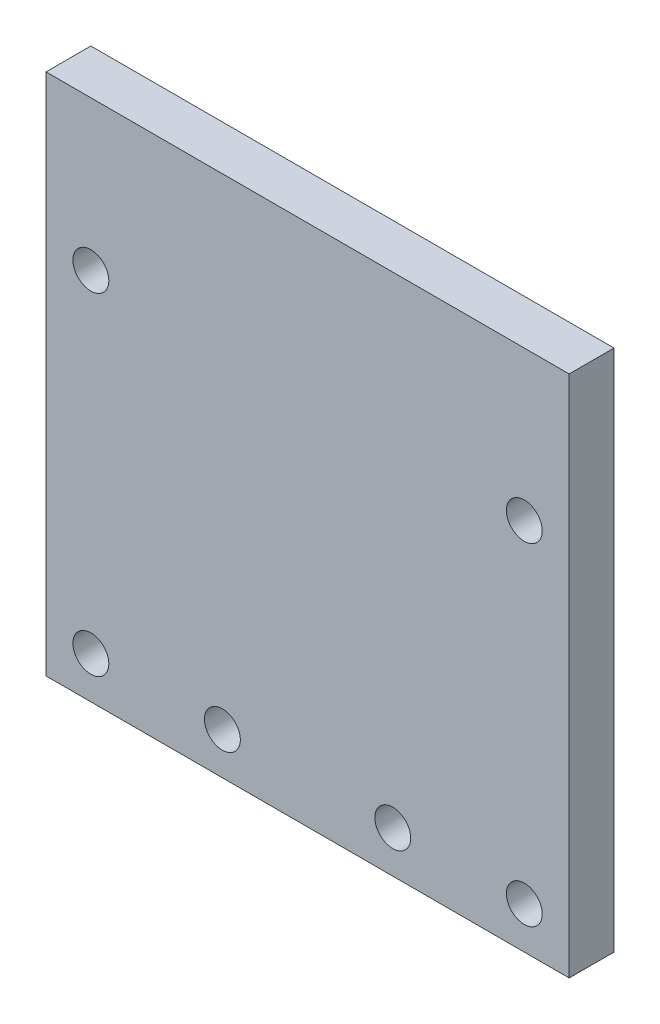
ISO-10303-21;
HEADER;
FILE_DESCRIPTION(('STEP AP214'),'2;1');
FILE_NAME('part.step','',(''),(''),'','','');
FILE_SCHEMA(('AUTOMOTIVE_DESIGN { 1 0 10303 214 1 1 1 1 }'));
ENDSEC;
DATA;
#1=APPLICATION_CONTEXT('core data for automotive mechanical design processes');
#2=APPLICATION_PROTOCOL_DEFINITION('international standard','automotive_design',2000,#1);
#3=PRODUCT_CONTEXT('',#1,'mechanical');
#4=PRODUCT('Part','Part','',(#3));
#5=PRODUCT_RELATED_PRODUCT_CATEGORY('part','',(#4));
#6=PRODUCT_DEFINITION_FORMATION('','',#4);
#7=PRODUCT_DEFINITION_CONTEXT('part definition',#1,'design');
#8=PRODUCT_DEFINITION('design','',#6,#7);
#9=PRODUCT_DEFINITION_SHAPE('','',#8);
#10=(LENGTH_UNIT() NAMED_UNIT(*) SI_UNIT(.MILLI.,.METRE.));
#11=(NAMED_UNIT(*) PLANE_ANGLE_UNIT() SI_UNIT($,.RADIAN.));
#12=(NAMED_UNIT(*) SI_UNIT($,.STERADIAN.) SOLID_ANGLE_UNIT());
#13=UNCERTAINTY_MEASURE_WITH_UNIT(LENGTH_MEASURE(1.E-05),#10,'distance_accuracy_value','');
#14=(GEOMETRIC_REPRESENTATION_CONTEXT(3) GLOBAL_UNCERTAINTY_ASSIGNED_CONTEXT((#13)) GLOBAL_UNIT_ASSIGNED_CONTEXT((#10,
#11,#12)) REPRESENTATION_CONTEXT('',''));
#15=CARTESIAN_POINT('',(0.,0.,0.));
#16=DIRECTION('',(0.,0.,1.));
#17=DIRECTION('',(1.,0.,0.));
#18=AXIS2_PLACEMENT_3D('',#15,#16,#17);
#19=CARTESIAN_POINT('',(0.,0.,0.));
#20=DIRECTION('',(0.,0.,-1.));
#21=DIRECTION('',(0.,-1.,0.));
#22=AXIS2_PLACEMENT_3D('',#19,#20,#21);
#23=PLANE('',#22);
#24=CARTESIAN_POINT('',(3.,25.,0.));
#25=DIRECTION('',(0.,0.,-1.));
#26=DIRECTION('',(-1.,0.,0.));
#27=AXIS2_PLACEMENT_3D('',#24,#25,#26);
#28=CIRCLE('',#27,1.2);
#29=CARTESIAN_POINT('',(1.8,25.,0.));
#30=VERTEX_POINT('',#29);
#31=EDGE_CURVE('E112',#30,#30,#28,.T.);
#32=ORIENTED_EDGE('',*,*,#31,.F.);
#33=EDGE_LOOP('',(#32));
#34=FACE_BOUND('',#33,.T.);
#35=CARTESIAN_POINT('',(11.8,2.8,0.));
#36=DIRECTION('',(0.,0.,-1.));
#37=DIRECTION('',(-1.,0.,0.));
#38=AXIS2_PLACEMENT_3D('',#35,#36,#37);
#39=CIRCLE('',#38,1.2);
#40=CARTESIAN_POINT('',(10.6,2.8,0.));
#41=VERTEX_POINT('',#40);
#42=EDGE_CURVE('E144',#41,#41,#39,.T.);
#43=ORIENTED_EDGE('',*,*,#42,.F.);
#44=EDGE_LOOP('',(#43));
#45=FACE_BOUND('',#44,.T.);
#46=CARTESIAN_POINT('',(32.,2.8,0.));
#47=DIRECTION('',(0.,0.,-1.));
#48=DIRECTION('',(-1.,0.,0.));
#49=AXIS2_PLACEMENT_3D('',#46,#47,#48);
#50=CIRCLE('',#49,1.2);
#51=CARTESIAN_POINT('',(30.8,2.8,0.));
#52=VERTEX_POINT('',#51);
#53=EDGE_CURVE('E136',#52,#52,#50,.T.);
#54=ORIENTED_EDGE('',*,*,#53,.F.);
#55=EDGE_LOOP('',(#54));
#56=FACE_BOUND('',#55,.T.);
#57=CARTESIAN_POINT('',(23.2,2.8,0.));
#58=DIRECTION('',(0.,0.,-1.));
#59=DIRECTION('',(-1.,0.,0.));
#60=AXIS2_PLACEMENT_3D('',#57,#58,#59);
#61=CIRCLE('',#60,1.2);
#62=CARTESIAN_POINT('',(22.,2.8,0.));
#63=VERTEX_POINT('',#62);
#64=EDGE_CURVE('E125',#63,#63,#61,.T.);
#65=ORIENTED_EDGE('',*,*,#64,.F.);
#66=EDGE_LOOP('',(#65));
#67=FACE_BOUND('',#66,.T.);
#68=CARTESIAN_POINT('',(32.,25.,0.));
#69=DIRECTION('',(0.,0.,-1.));
#70=DIRECTION('',(-1.,0.,0.));
#71=AXIS2_PLACEMENT_3D('',#68,#69,#70);
#72=CIRCLE('',#71,1.2);
#73=CARTESIAN_POINT('',(30.8,25.,0.));
#74=VERTEX_POINT('',#73);
#75=EDGE_CURVE('E157',#74,#74,#72,.T.);
#76=ORIENTED_EDGE('',*,*,#75,.F.);
#77=EDGE_LOOP('',(#76));
#78=FACE_BOUND('',#77,.T.);
#79=CARTESIAN_POINT('',(3.,2.8,0.));
#80=DIRECTION('',(0.,0.,-1.));
#81=DIRECTION('',(-1.,0.,0.));
#82=AXIS2_PLACEMENT_3D('',#79,#80,#81);
#83=CIRCLE('',#82,1.2);
#84=CARTESIAN_POINT('',(1.8,2.8,0.));
#85=VERTEX_POINT('',#84);
#86=EDGE_CURVE('E148',#85,#85,#83,.T.);
#87=ORIENTED_EDGE('',*,*,#86,.F.);
#88=EDGE_LOOP('',(#87));
#89=FACE_BOUND('',#88,.T.);
#90=DIRECTION('',(0.,-1.,0.));
#91=VECTOR('',#90,1.);
#92=CARTESIAN_POINT('',(0.,0.,0.));
#93=LINE('',#92,#91);
#94=CARTESIAN_POINT('',(0.,35.,0.));
#95=VERTEX_POINT('',#94);
#96=CARTESIAN_POINT('',(0.,0.,0.));
#97=VERTEX_POINT('',#96);
#98=EDGE_CURVE('E89',#95,#97,#93,.T.);
#99=ORIENTED_EDGE('',*,*,#98,.F.);
#100=DIRECTION('',(-1.,0.,0.));
#101=VECTOR('',#100,1.);
#102=CARTESIAN_POINT('',(0.,35.,0.));
#103=LINE('',#102,#101);
#104=CARTESIAN_POINT('',(35.,35.,0.));
#105=VERTEX_POINT('',#104);
#106=EDGE_CURVE('E49',#105,#95,#103,.T.);
#107=ORIENTED_EDGE('',*,*,#106,.F.);
#108=DIRECTION('',(0.,1.,0.));
#109=VECTOR('',#108,1.);
#110=CARTESIAN_POINT('',(35.,0.,0.));
#111=LINE('',#110,#109);
#112=CARTESIAN_POINT('',(35.,0.,0.));
#113=VERTEX_POINT('',#112);
#114=EDGE_CURVE('E91',#113,#105,#111,.T.);
#115=ORIENTED_EDGE('',*,*,#114,.F.);
#116=DIRECTION('',(1.,0.,0.));
#117=VECTOR('',#116,1.);
#118=CARTESIAN_POINT('',(0.,0.,0.));
#119=LINE('',#118,#117);
#120=EDGE_CURVE('E86',#97,#113,#119,.T.);
#121=ORIENTED_EDGE('',*,*,#120,.F.);
#122=EDGE_LOOP('',(#99,#107,#115,#121));
#123=FACE_BOUND('',#122,.T.);
#124=ADVANCED_FACE('F38',(#34,#45,#56,#67,#78,#89,#123),#23,.T.);
#125=CARTESIAN_POINT('',(0.,0.,3.));
#126=DIRECTION('',(0.,0.,-1.));
#127=DIRECTION('',(0.,-1.,0.));
#128=AXIS2_PLACEMENT_3D('',#125,#126,#127);
#129=PLANE('',#128);
#130=CARTESIAN_POINT('',(3.,25.,3.));
#131=DIRECTION('',(0.,0.,-1.));
#132=DIRECTION('',(-1.,0.,0.));
#133=AXIS2_PLACEMENT_3D('',#130,#131,#132);
#134=CIRCLE('',#133,1.2);
#135=CARTESIAN_POINT('',(1.8,25.,3.));
#136=VERTEX_POINT('',#135);
#137=EDGE_CURVE('E119',#136,#136,#134,.T.);
#138=ORIENTED_EDGE('',*,*,#137,.T.);
#139=EDGE_LOOP('',(#138));
#140=FACE_BOUND('',#139,.T.);
#141=CARTESIAN_POINT('',(11.8,2.8,3.));
#142=DIRECTION('',(0.,0.,-1.));
#143=DIRECTION('',(-1.,0.,0.));
#144=AXIS2_PLACEMENT_3D('',#141,#142,#143);
#145=CIRCLE('',#144,1.2);
#146=CARTESIAN_POINT('',(10.6,2.8,3.));
#147=VERTEX_POINT('',#146);
#148=EDGE_CURVE('E140',#147,#147,#145,.T.);
#149=ORIENTED_EDGE('',*,*,#148,.T.);
#150=EDGE_LOOP('',(#149));
#151=FACE_BOUND('',#150,.T.);
#152=CARTESIAN_POINT('',(32.,2.8,3.));
#153=DIRECTION('',(0.,0.,-1.));
#154=DIRECTION('',(-1.,0.,0.));
#155=AXIS2_PLACEMENT_3D('',#152,#153,#154);
#156=CIRCLE('',#155,1.2);
#157=CARTESIAN_POINT('',(30.8,2.8,3.));
#158=VERTEX_POINT('',#157);
#159=EDGE_CURVE('E123',#158,#158,#156,.T.);
#160=ORIENTED_EDGE('',*,*,#159,.T.);
#161=EDGE_LOOP('',(#160));
#162=FACE_BOUND('',#161,.T.);
#163=CARTESIAN_POINT('',(23.2,2.8,3.));
#164=DIRECTION('',(0.,0.,-1.));
#165=DIRECTION('',(-1.,0.,0.));
#166=AXIS2_PLACEMENT_3D('',#163,#164,#165);
#167=CIRCLE('',#166,1.2);
#168=CARTESIAN_POINT('',(22.,2.8,3.));
#169=VERTEX_POINT('',#168);
#170=EDGE_CURVE('E128',#169,#169,#167,.T.);
#171=ORIENTED_EDGE('',*,*,#170,.T.);
#172=EDGE_LOOP('',(#171));
#173=FACE_BOUND('',#172,.T.);
#174=CARTESIAN_POINT('',(32.,25.,3.));
#175=DIRECTION('',(0.,0.,-1.));
#176=DIRECTION('',(-1.,0.,0.));
#177=AXIS2_PLACEMENT_3D('',#174,#175,#176);
#178=CIRCLE('',#177,1.2);
#179=CARTESIAN_POINT('',(30.8,25.,3.));
#180=VERTEX_POINT('',#179);
#181=EDGE_CURVE('E153',#180,#180,#178,.T.);
#182=ORIENTED_EDGE('',*,*,#181,.T.);
#183=EDGE_LOOP('',(#182));
#184=FACE_BOUND('',#183,.T.);
#185=CARTESIAN_POINT('',(3.,2.8,3.));
#186=DIRECTION('',(0.,0.,-1.));
#187=DIRECTION('',(-1.,0.,0.));
#188=AXIS2_PLACEMENT_3D('',#185,#186,#187);
#189=CIRCLE('',#188,1.2);
#190=CARTESIAN_POINT('',(1.8,2.8,3.));
#191=VERTEX_POINT('',#190);
#192=EDGE_CURVE('E145',#191,#191,#189,.T.);
#193=ORIENTED_EDGE('',*,*,#192,.T.);
#194=EDGE_LOOP('',(#193));
#195=FACE_BOUND('',#194,.T.);
#196=DIRECTION('',(0.,-1.,0.));
#197=VECTOR('',#196,1.);
#198=CARTESIAN_POINT('',(0.,0.,3.));
#199=LINE('',#198,#197);
#200=CARTESIAN_POINT('',(0.,35.,3.));
#201=VERTEX_POINT('',#200);
#202=CARTESIAN_POINT('',(0.,0.,3.));
#203=VERTEX_POINT('',#202);
#204=EDGE_CURVE('E108',#201,#203,#199,.T.);
#205=ORIENTED_EDGE('',*,*,#204,.T.);
#206=DIRECTION('',(1.,0.,0.));
#207=VECTOR('',#206,1.);
#208=CARTESIAN_POINT('',(0.,0.,3.));
#209=LINE('',#208,#207);
#210=CARTESIAN_POINT('',(35.,0.,3.));
#211=VERTEX_POINT('',#210);
#212=EDGE_CURVE('E103',#203,#211,#209,.T.);
#213=ORIENTED_EDGE('',*,*,#212,.T.);
#214=DIRECTION('',(0.,1.,0.));
#215=VECTOR('',#214,1.);
#216=CARTESIAN_POINT('',(35.,0.,3.));
#217=LINE('',#216,#215);
#218=CARTESIAN_POINT('',(35.,35.,3.));
#219=VERTEX_POINT('',#218);
#220=EDGE_CURVE('E131',#211,#219,#217,.T.);
#221=ORIENTED_EDGE('',*,*,#220,.T.);
#222=DIRECTION('',(-1.,0.,0.));
#223=VECTOR('',#222,1.);
#224=CARTESIAN_POINT('',(0.,35.,3.));
#225=LINE('',#224,#223);
#226=EDGE_CURVE('E11',#219,#201,#225,.T.);
#227=ORIENTED_EDGE('',*,*,#226,.T.);
#228=EDGE_LOOP('',(#205,#213,#221,#227));
#229=FACE_BOUND('',#228,.T.);
#230=ADVANCED_FACE('F40',(#140,#151,#162,#173,#184,#195,#229),#129,.F.);
#231=CARTESIAN_POINT('',(0.,35.,3.));
#232=DIRECTION('',(0.,-1.,0.));
#233=DIRECTION('',(0.,0.,-1.));
#234=AXIS2_PLACEMENT_3D('',#231,#232,#233);
#235=PLANE('',#234);
#236=ORIENTED_EDGE('',*,*,#106,.T.);
#237=DIRECTION('',(0.,0.,-1.));
#238=VECTOR('',#237,1.);
#239=CARTESIAN_POINT('',(0.,35.,3.));
#240=LINE('',#239,#238);
#241=EDGE_CURVE('E97',#201,#95,#240,.T.);
#242=ORIENTED_EDGE('',*,*,#241,.F.);
#243=ORIENTED_EDGE('',*,*,#226,.F.);
#244=DIRECTION('',(0.,0.,-1.));
#245=VECTOR('',#244,1.);
#246=CARTESIAN_POINT('',(35.,35.,3.));
#247=LINE('',#246,#245);
#248=EDGE_CURVE('E42',#219,#105,#247,.T.);
#249=ORIENTED_EDGE('',*,*,#248,.T.);
#250=EDGE_LOOP('',(#236,#242,#243,#249));
#251=FACE_BOUND('',#250,.T.);
#252=ADVANCED_FACE('F187',(#251),#235,.F.);
#253=CARTESIAN_POINT('',(35.,0.,3.));
#254=DIRECTION('',(-1.,0.,0.));
#255=DIRECTION('',(0.,0.,1.));
#256=AXIS2_PLACEMENT_3D('',#253,#254,#255);
#257=PLANE('',#256);
#258=ORIENTED_EDGE('',*,*,#114,.T.);
#259=ORIENTED_EDGE('',*,*,#248,.F.);
#260=ORIENTED_EDGE('',*,*,#220,.F.);
#261=DIRECTION('',(0.,0.,-1.));
#262=VECTOR('',#261,1.);
#263=CARTESIAN_POINT('',(35.,0.,3.));
#264=LINE('',#263,#262);
#265=EDGE_CURVE('E96',#211,#113,#264,.T.);
#266=ORIENTED_EDGE('',*,*,#265,.T.);
#267=EDGE_LOOP('',(#258,#259,#260,#266));
#268=FACE_BOUND('',#267,.T.);
#269=ADVANCED_FACE('F181',(#268),#257,.F.);
#270=CARTESIAN_POINT('',(0.,0.,3.));
#271=DIRECTION('',(0.,1.,0.));
#272=DIRECTION('',(1.,0.,0.));
#273=AXIS2_PLACEMENT_3D('',#270,#271,#272);
#274=PLANE('',#273);
#275=ORIENTED_EDGE('',*,*,#120,.T.);
#276=ORIENTED_EDGE('',*,*,#265,.F.);
#277=ORIENTED_EDGE('',*,*,#212,.F.);
#278=DIRECTION('',(0.,0.,-1.));
#279=VECTOR('',#278,1.);
#280=CARTESIAN_POINT('',(0.,0.,3.));
#281=LINE('',#280,#279);
#282=EDGE_CURVE('E100',#203,#97,#281,.T.);
#283=ORIENTED_EDGE('',*,*,#282,.T.);
#284=EDGE_LOOP('',(#275,#276,#277,#283));
#285=FACE_BOUND('',#284,.T.);
#286=ADVANCED_FACE('F101',(#285),#274,.F.);
#287=CARTESIAN_POINT('',(0.,0.,3.));
#288=DIRECTION('',(1.,0.,0.));
#289=DIRECTION('',(0.,1.,0.));
#290=AXIS2_PLACEMENT_3D('',#287,#288,#289);
#291=PLANE('',#290);
#292=ORIENTED_EDGE('',*,*,#98,.T.);
#293=ORIENTED_EDGE('',*,*,#282,.F.);
#294=ORIENTED_EDGE('',*,*,#204,.F.);
#295=ORIENTED_EDGE('',*,*,#241,.T.);
#296=EDGE_LOOP('',(#292,#293,#294,#295));
#297=FACE_BOUND('',#296,.T.);
#298=ADVANCED_FACE('F110',(#297),#291,.F.);
#299=CARTESIAN_POINT('',(3.,25.,3.));
#300=DIRECTION('',(0.,0.,-1.));
#301=DIRECTION('',(-1.,0.,0.));
#302=AXIS2_PLACEMENT_3D('',#299,#300,#301);
#303=CYLINDRICAL_SURFACE('',#302,1.2);
#304=ORIENTED_EDGE('',*,*,#31,.T.);
#305=EDGE_LOOP('',(#304));
#306=FACE_BOUND('',#305,.T.);
#307=ORIENTED_EDGE('',*,*,#137,.F.);
#308=EDGE_LOOP('',(#307));
#309=FACE_BOUND('',#308,.T.);
#310=ADVANCED_FACE('F232',(#306,#309),#303,.F.);
#311=CARTESIAN_POINT('',(11.8,2.8,3.));
#312=DIRECTION('',(0.,0.,-1.));
#313=DIRECTION('',(-1.,0.,0.));
#314=AXIS2_PLACEMENT_3D('',#311,#312,#313);
#315=CYLINDRICAL_SURFACE('',#314,1.2);
#316=ORIENTED_EDGE('',*,*,#42,.T.);
#317=EDGE_LOOP('',(#316));
#318=FACE_BOUND('',#317,.T.);
#319=ORIENTED_EDGE('',*,*,#148,.F.);
#320=EDGE_LOOP('',(#319));
#321=FACE_BOUND('',#320,.T.);
#322=ADVANCED_FACE('F224',(#318,#321),#315,.F.);
#323=CARTESIAN_POINT('',(32.,2.8,3.));
#324=DIRECTION('',(0.,0.,-1.));
#325=DIRECTION('',(-1.,0.,0.));
#326=AXIS2_PLACEMENT_3D('',#323,#324,#325);
#327=CYLINDRICAL_SURFACE('',#326,1.2);
#328=ORIENTED_EDGE('',*,*,#53,.T.);
#329=EDGE_LOOP('',(#328));
#330=FACE_BOUND('',#329,.T.);
#331=ORIENTED_EDGE('',*,*,#159,.F.);
#332=EDGE_LOOP('',(#331));
#333=FACE_BOUND('',#332,.T.);
#334=ADVANCED_FACE('F222',(#330,#333),#327,.F.);
#335=CARTESIAN_POINT('',(23.2,2.8,3.));
#336=DIRECTION('',(0.,0.,-1.));
#337=DIRECTION('',(-1.,0.,0.));
#338=AXIS2_PLACEMENT_3D('',#335,#336,#337);
#339=CYLINDRICAL_SURFACE('',#338,1.2);
#340=ORIENTED_EDGE('',*,*,#64,.T.);
#341=EDGE_LOOP('',(#340));
#342=FACE_BOUND('',#341,.T.);
#343=ORIENTED_EDGE('',*,*,#170,.F.);
#344=EDGE_LOOP('',(#343));
#345=FACE_BOUND('',#344,.T.);
#346=ADVANCED_FACE('F218',(#342,#345),#339,.F.);
#347=CARTESIAN_POINT('',(32.,25.,3.));
#348=DIRECTION('',(0.,0.,-1.));
#349=DIRECTION('',(-1.,0.,0.));
#350=AXIS2_PLACEMENT_3D('',#347,#348,#349);
#351=CYLINDRICAL_SURFACE('',#350,1.2);
#352=ORIENTED_EDGE('',*,*,#75,.T.);
#353=EDGE_LOOP('',(#352));
#354=FACE_BOUND('',#353,.T.);
#355=ORIENTED_EDGE('',*,*,#181,.F.);
#356=EDGE_LOOP('',(#355));
#357=FACE_BOUND('',#356,.T.);
#358=ADVANCED_FACE('F212',(#354,#357),#351,.F.);
#359=CARTESIAN_POINT('',(3.,2.8,3.));
#360=DIRECTION('',(0.,0.,-1.));
#361=DIRECTION('',(-1.,0.,0.));
#362=AXIS2_PLACEMENT_3D('',#359,#360,#361);
#363=CYLINDRICAL_SURFACE('',#362,1.2);
#364=ORIENTED_EDGE('',*,*,#86,.T.);
#365=EDGE_LOOP('',(#364));
#366=FACE_BOUND('',#365,.T.);
#367=ORIENTED_EDGE('',*,*,#192,.F.);
#368=EDGE_LOOP('',(#367));
#369=FACE_BOUND('',#368,.T.);
#370=ADVANCED_FACE('F210',(#366,#369),#363,.F.);
#371=CLOSED_SHELL('',(#124,#230,#252,#269,#286,#298,#310,#322,#334,#346,#358,#370));
#372=MANIFOLD_SOLID_BREP('B2',#371);
#373=ADVANCED_BREP_SHAPE_REPRESENTATION('',(#18,#372),#14);
#374=SHAPE_DEFINITION_REPRESENTATION(#9,#373);
ENDSEC;
END-ISO-10303-21;
